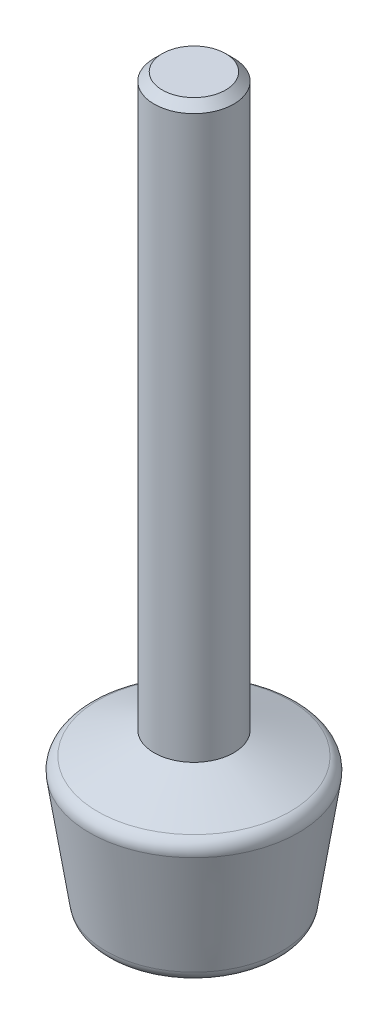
ISO-10303-21;
HEADER;
FILE_DESCRIPTION(('STEP AP214'),'2;1');
FILE_NAME('part.step','',(''),(''),'','','');
FILE_SCHEMA(('AUTOMOTIVE_DESIGN { 1 0 10303 214 1 1 1 1 }'));
ENDSEC;
DATA;
#1=APPLICATION_CONTEXT('core data for automotive mechanical design processes');
#2=APPLICATION_PROTOCOL_DEFINITION('international standard','automotive_design',2000,#1);
#3=PRODUCT_CONTEXT('',#1,'mechanical');
#4=PRODUCT('Part','Part','',(#3));
#5=PRODUCT_RELATED_PRODUCT_CATEGORY('part','',(#4));
#6=PRODUCT_DEFINITION_FORMATION('','',#4);
#7=PRODUCT_DEFINITION_CONTEXT('part definition',#1,'design');
#8=PRODUCT_DEFINITION('design','',#6,#7);
#9=PRODUCT_DEFINITION_SHAPE('','',#8);
#10=(LENGTH_UNIT() NAMED_UNIT(*) SI_UNIT(.MILLI.,.METRE.));
#11=(NAMED_UNIT(*) PLANE_ANGLE_UNIT() SI_UNIT($,.RADIAN.));
#12=(NAMED_UNIT(*) SI_UNIT($,.STERADIAN.) SOLID_ANGLE_UNIT());
#13=UNCERTAINTY_MEASURE_WITH_UNIT(LENGTH_MEASURE(1.E-05),#10,'distance_accuracy_value','');
#14=(GEOMETRIC_REPRESENTATION_CONTEXT(3) GLOBAL_UNCERTAINTY_ASSIGNED_CONTEXT((#13)) GLOBAL_UNIT_ASSIGNED_CONTEXT((#10,
#11,#12)) REPRESENTATION_CONTEXT('',''));
#15=CARTESIAN_POINT('',(0.,0.,0.));
#16=DIRECTION('',(0.,0.,1.));
#17=DIRECTION('',(1.,0.,0.));
#18=AXIS2_PLACEMENT_3D('',#15,#16,#17);
#19=CARTESIAN_POINT('',(5.63881257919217,0.,0.));
#20=DIRECTION('',(0.,1.,0.));
#21=DIRECTION('',(0.,0.,1.));
#22=AXIS2_PLACEMENT_3D('',#19,#20,#21);
#23=PLANE('',#22);
#24=CARTESIAN_POINT('',(0.,0.,0.));
#25=DIRECTION('',(0.,1.,0.));
#26=DIRECTION('',(0.,0.,-1.));
#27=AXIS2_PLACEMENT_3D('',#24,#25,#26);
#28=CIRCLE('',#27,5.63881257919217);
#29=CARTESIAN_POINT('',(0.,0.,-5.63881257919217));
#30=VERTEX_POINT('',#29);
#31=EDGE_CURVE('E69',#30,#30,#28,.T.);
#32=ORIENTED_EDGE('',*,*,#31,.F.);
#33=EDGE_LOOP('',(#32));
#34=FACE_BOUND('',#33,.T.);
#35=ADVANCED_FACE('F14',(#34),#23,.F.);
#36=CARTESIAN_POINT('',(0.,1.,0.));
#37=DIRECTION('',(0.,-1.,0.));
#38=DIRECTION('',(0.,0.,-1.));
#39=AXIS2_PLACEMENT_3D('',#36,#37,#38);
#40=TOROIDAL_SURFACE('',#39,5.6388125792,1.);
#41=ORIENTED_EDGE('',*,*,#31,.T.);
#42=EDGE_LOOP('',(#41));
#43=FACE_BOUND('',#42,.T.);
#44=CARTESIAN_POINT('',(0.,0.851659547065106,0.));
#45=DIRECTION('',(0.,1.,0.));
#46=DIRECTION('',(0.,0.,1.));
#47=AXIS2_PLACEMENT_3D('',#44,#45,#46);
#48=CIRCLE('',#47,6.62774893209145);
#49=CARTESIAN_POINT('',(0.,0.851659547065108,6.62774893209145));
#50=VERTEX_POINT('',#49);
#51=EDGE_CURVE('E206',#50,#50,#48,.T.);
#52=ORIENTED_EDGE('',*,*,#51,.F.);
#53=EDGE_LOOP('',(#52));
#54=FACE_BOUND('',#53,.T.);
#55=ADVANCED_FACE('F53',(#43,#54),#40,.T.);
#56=CARTESIAN_POINT('',(0.,9.21717087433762,0.));
#57=DIRECTION('',(0.,1.,0.));
#58=DIRECTION('',(0.,0.,1.));
#59=AXIS2_PLACEMENT_3D('',#56,#57,#58);
#60=CONICAL_SURFACE('',#59,7.88257563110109,0.1488899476);
#61=CARTESIAN_POINT('',(0.,9.2171708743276,0.));
#62=DIRECTION('',(0.,-1.,0.));
#63=DIRECTION('',(0.,0.,-1.));
#64=AXIS2_PLACEMENT_3D('',#61,#62,#63);
#65=CIRCLE('',#64,7.88257563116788);
#66=CARTESIAN_POINT('',(0.,9.2171708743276,-7.88257563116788));
#67=VERTEX_POINT('',#66);
#68=EDGE_CURVE('E37',#67,#67,#65,.F.);
#69=ORIENTED_EDGE('',*,*,#68,.F.);
#70=EDGE_LOOP('',(#69));
#71=FACE_BOUND('',#70,.T.);
#72=ORIENTED_EDGE('',*,*,#51,.T.);
#73=EDGE_LOOP('',(#72));
#74=FACE_BOUND('',#73,.T.);
#75=ADVANCED_FACE('F49',(#71,#74),#60,.T.);
#76=CARTESIAN_POINT('',(0.,9.3655113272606,0.));
#77=DIRECTION('',(0.,-1.,0.));
#78=DIRECTION('',(0.,0.,-1.));
#79=AXIS2_PLACEMENT_3D('',#76,#77,#78);
#80=TOROIDAL_SURFACE('',#79,6.8936392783,1.);
#81=ORIENTED_EDGE('',*,*,#68,.T.);
#82=EDGE_LOOP('',(#81));
#83=FACE_BOUND('',#82,.T.);
#84=CARTESIAN_POINT('',(0.,10.2939880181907,0.));
#85=DIRECTION('',(0.,-1.,0.));
#86=DIRECTION('',(0.,0.,-1.));
#87=AXIS2_PLACEMENT_3D('',#84,#85,#86);
#88=CIRCLE('',#87,7.26502995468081);
#89=CARTESIAN_POINT('',(0.,10.2939880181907,-7.26502995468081));
#90=VERTEX_POINT('',#89);
#91=EDGE_CURVE('E34',#90,#90,#88,.F.);
#92=ORIENTED_EDGE('',*,*,#91,.F.);
#93=EDGE_LOOP('',(#92));
#94=FACE_BOUND('',#93,.T.);
#95=ADVANCED_FACE('F44',(#83,#94),#80,.T.);
#96=CARTESIAN_POINT('',(0.,55.,0.));
#97=DIRECTION('',(0.,-1.,0.));
#98=DIRECTION('',(0.,0.,-1.));
#99=AXIS2_PLACEMENT_3D('',#96,#97,#98);
#100=PLANE('',#99);
#101=CARTESIAN_POINT('',(0.,55.0000000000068,0.));
#102=DIRECTION('',(0.,-1.,0.));
#103=DIRECTION('',(0.,0.,-1.));
#104=AXIS2_PLACEMENT_3D('',#101,#102,#103);
#105=CIRCLE('',#104,2.38650000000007);
#106=CARTESIAN_POINT('',(0.,55.0000000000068,-2.38650000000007));
#107=VERTEX_POINT('',#106);
#108=EDGE_CURVE('E27',#107,#107,#105,.T.);
#109=ORIENTED_EDGE('',*,*,#108,.F.);
#110=EDGE_LOOP('',(#109));
#111=FACE_BOUND('',#110,.T.);
#112=ADVANCED_FACE('F48',(#111),#100,.F.);
#113=CARTESIAN_POINT('',(0.,10.2939880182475,0.));
#114=DIRECTION('',(0.,-1.,0.));
#115=DIRECTION('',(0.,0.,-1.));
#116=AXIS2_PLACEMENT_3D('',#113,#114,#115);
#117=CONICAL_SURFACE('',#116,7.26502995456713,1.19028994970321);
#118=CARTESIAN_POINT('',(0.,12.,0.));
#119=DIRECTION('',(0.,1.,0.));
#120=DIRECTION('',(0.,0.,1.));
#121=AXIS2_PLACEMENT_3D('',#118,#119,#120);
#122=CIRCLE('',#121,3.);
#123=CARTESIAN_POINT('',(0.,12.,3.));
#124=VERTEX_POINT('',#123);
#125=EDGE_CURVE('E22',#124,#124,#122,.T.);
#126=ORIENTED_EDGE('',*,*,#125,.F.);
#127=EDGE_LOOP('',(#126));
#128=FACE_BOUND('',#127,.T.);
#129=ORIENTED_EDGE('',*,*,#91,.T.);
#130=EDGE_LOOP('',(#129));
#131=FACE_BOUND('',#130,.T.);
#132=ADVANCED_FACE('F92',(#128,#131),#117,.T.);
#133=CARTESIAN_POINT('',(0.,54.3864999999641,0.));
#134=DIRECTION('',(0.,-1.,0.));
#135=DIRECTION('',(0.,0.,-1.));
#136=AXIS2_PLACEMENT_3D('',#133,#134,#135);
#137=CONICAL_SURFACE('',#136,3.00000000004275,0.785398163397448);
#138=ORIENTED_EDGE('',*,*,#108,.T.);
#139=EDGE_LOOP('',(#138));
#140=FACE_BOUND('',#139,.T.);
#141=CARTESIAN_POINT('',(0.,54.3865,0.));
#142=DIRECTION('',(0.,1.,0.));
#143=DIRECTION('',(0.,0.,1.));
#144=AXIS2_PLACEMENT_3D('',#141,#142,#143);
#145=CIRCLE('',#144,3.);
#146=CARTESIAN_POINT('',(0.,54.3865,3.));
#147=VERTEX_POINT('',#146);
#148=EDGE_CURVE('E10',#147,#147,#145,.F.);
#149=ORIENTED_EDGE('',*,*,#148,.F.);
#150=EDGE_LOOP('',(#149));
#151=FACE_BOUND('',#150,.T.);
#152=ADVANCED_FACE('F88',(#140,#151),#137,.T.);
#153=CARTESIAN_POINT('',(0.,0.,0.));
#154=DIRECTION('',(0.,1.,0.));
#155=DIRECTION('',(0.,0.,1.));
#156=AXIS2_PLACEMENT_3D('',#153,#154,#155);
#157=CYLINDRICAL_SURFACE('',#156,3.);
#158=ORIENTED_EDGE('',*,*,#148,.T.);
#159=EDGE_LOOP('',(#158));
#160=FACE_BOUND('',#159,.T.);
#161=ORIENTED_EDGE('',*,*,#125,.T.);
#162=EDGE_LOOP('',(#161));
#163=FACE_BOUND('',#162,.T.);
#164=ADVANCED_FACE('F98',(#160,#163),#157,.T.);
#165=CLOSED_SHELL('',(#35,#55,#75,#95,#112,#132,#152,#164));
#166=MANIFOLD_SOLID_BREP('B1',#165);
#167=ADVANCED_BREP_SHAPE_REPRESENTATION('',(#18,#166),#14);
#168=SHAPE_DEFINITION_REPRESENTATION(#9,#167);
ENDSEC;
END-ISO-10303-21;
